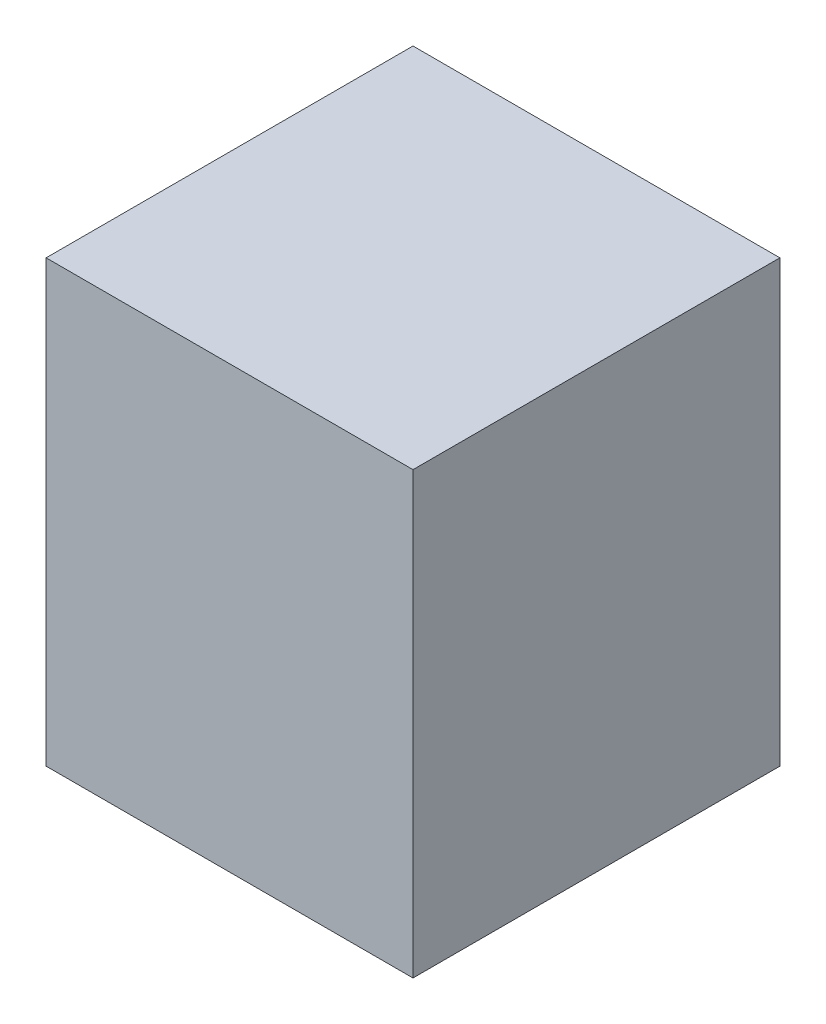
ISO-10303-21;
HEADER;
FILE_DESCRIPTION(('STEP AP214'),'2;1');
FILE_NAME('part.step','',(''),(''),'','','');
FILE_SCHEMA(('AUTOMOTIVE_DESIGN { 1 0 10303 214 1 1 1 1 }'));
ENDSEC;
DATA;
#1=APPLICATION_CONTEXT('core data for automotive mechanical design processes');
#2=APPLICATION_PROTOCOL_DEFINITION('international standard','automotive_design',2000,#1);
#3=PRODUCT_CONTEXT('',#1,'mechanical');
#4=PRODUCT('Part','Part','',(#3));
#5=PRODUCT_RELATED_PRODUCT_CATEGORY('part','',(#4));
#6=PRODUCT_DEFINITION_FORMATION('','',#4);
#7=PRODUCT_DEFINITION_CONTEXT('part definition',#1,'design');
#8=PRODUCT_DEFINITION('design','',#6,#7);
#9=PRODUCT_DEFINITION_SHAPE('','',#8);
#10=(LENGTH_UNIT() NAMED_UNIT(*) SI_UNIT(.MILLI.,.METRE.));
#11=(NAMED_UNIT(*) PLANE_ANGLE_UNIT() SI_UNIT($,.RADIAN.));
#12=(NAMED_UNIT(*) SI_UNIT($,.STERADIAN.) SOLID_ANGLE_UNIT());
#13=UNCERTAINTY_MEASURE_WITH_UNIT(LENGTH_MEASURE(1.E-05),#10,'distance_accuracy_value','');
#14=(GEOMETRIC_REPRESENTATION_CONTEXT(3) GLOBAL_UNCERTAINTY_ASSIGNED_CONTEXT((#13)) GLOBAL_UNIT_ASSIGNED_CONTEXT((#10,
#11,#12)) REPRESENTATION_CONTEXT('',''));
#15=CARTESIAN_POINT('',(0.,0.,0.));
#16=DIRECTION('',(0.,0.,1.));
#17=DIRECTION('',(1.,0.,0.));
#18=AXIS2_PLACEMENT_3D('',#15,#16,#17);
#19=CARTESIAN_POINT('',(0.,0.,0.499999));
#20=DIRECTION('',(0.,0.,1.));
#21=DIRECTION('',(1.,0.,0.));
#22=AXIS2_PLACEMENT_3D('',#19,#20,#21);
#23=PLANE('',#22);
#24=DIRECTION('',(1.,0.,0.));
#25=VECTOR('',#24,1.);
#26=CARTESIAN_POINT('',(-0.2499995,-0.2999994,0.499999));
#27=LINE('',#26,#25);
#28=CARTESIAN_POINT('',(-0.2499995,-0.2999994,0.499999));
#29=VERTEX_POINT('',#28);
#30=CARTESIAN_POINT('',(0.2499995,-0.2999994,0.499999));
#31=VERTEX_POINT('',#30);
#32=EDGE_CURVE('E82',#29,#31,#27,.T.);
#33=ORIENTED_EDGE('',*,*,#32,.T.);
#34=DIRECTION('',(0.,1.,0.));
#35=VECTOR('',#34,1.);
#36=CARTESIAN_POINT('',(0.2499995,-0.2999994,0.499999));
#37=LINE('',#36,#35);
#38=CARTESIAN_POINT('',(0.2499995,0.2999994,0.499999));
#39=VERTEX_POINT('',#38);
#40=EDGE_CURVE('E106',#31,#39,#37,.T.);
#41=ORIENTED_EDGE('',*,*,#40,.T.);
#42=DIRECTION('',(-1.,0.,0.));
#43=VECTOR('',#42,1.);
#44=CARTESIAN_POINT('',(0.2499995,0.2999994,0.499999));
#45=LINE('',#44,#43);
#46=CARTESIAN_POINT('',(-0.2499995,0.2999994,0.499999));
#47=VERTEX_POINT('',#46);
#48=EDGE_CURVE('E75',#39,#47,#45,.T.);
#49=ORIENTED_EDGE('',*,*,#48,.T.);
#50=DIRECTION('',(0.,-1.,0.));
#51=VECTOR('',#50,1.);
#52=CARTESIAN_POINT('',(-0.2499995,0.2999994,0.499999));
#53=LINE('',#52,#51);
#54=EDGE_CURVE('E11',#47,#29,#53,.T.);
#55=ORIENTED_EDGE('',*,*,#54,.T.);
#56=EDGE_LOOP('',(#33,#41,#49,#55));
#57=FACE_BOUND('',#56,.T.);
#58=ADVANCED_FACE('F17',(#57),#23,.T.);
#59=CARTESIAN_POINT('',(0.,0.,0.));
#60=DIRECTION('',(0.,0.,1.));
#61=DIRECTION('',(1.,0.,0.));
#62=AXIS2_PLACEMENT_3D('',#59,#60,#61);
#63=PLANE('',#62);
#64=DIRECTION('',(0.,-1.,0.));
#65=VECTOR('',#64,1.);
#66=CARTESIAN_POINT('',(-0.2499995,0.2999994,0.));
#67=LINE('',#66,#65);
#68=CARTESIAN_POINT('',(-0.2499995,0.2999994,0.));
#69=VERTEX_POINT('',#68);
#70=CARTESIAN_POINT('',(-0.2499995,-0.2999994,0.));
#71=VERTEX_POINT('',#70);
#72=EDGE_CURVE('E20',#69,#71,#67,.T.);
#73=ORIENTED_EDGE('',*,*,#72,.F.);
#74=DIRECTION('',(-1.,0.,0.));
#75=VECTOR('',#74,1.);
#76=CARTESIAN_POINT('',(0.2499995,0.2999994,0.));
#77=LINE('',#76,#75);
#78=CARTESIAN_POINT('',(0.2499995,0.2999994,0.));
#79=VERTEX_POINT('',#78);
#80=EDGE_CURVE('E110',#79,#69,#77,.T.);
#81=ORIENTED_EDGE('',*,*,#80,.F.);
#82=DIRECTION('',(0.,1.,0.));
#83=VECTOR('',#82,1.);
#84=CARTESIAN_POINT('',(0.2499995,-0.2999994,0.));
#85=LINE('',#84,#83);
#86=CARTESIAN_POINT('',(0.2499995,-0.2999994,0.));
#87=VERTEX_POINT('',#86);
#88=EDGE_CURVE('E84',#87,#79,#85,.T.);
#89=ORIENTED_EDGE('',*,*,#88,.F.);
#90=DIRECTION('',(1.,0.,0.));
#91=VECTOR('',#90,1.);
#92=CARTESIAN_POINT('',(-0.2499995,-0.2999994,0.));
#93=LINE('',#92,#91);
#94=EDGE_CURVE('E80',#71,#87,#93,.T.);
#95=ORIENTED_EDGE('',*,*,#94,.F.);
#96=EDGE_LOOP('',(#73,#81,#89,#95));
#97=FACE_BOUND('',#96,.T.);
#98=ADVANCED_FACE('F86',(#97),#63,.F.);
#99=CARTESIAN_POINT('',(-0.2499995,0.2999994,0.));
#100=DIRECTION('',(1.,0.,0.));
#101=DIRECTION('',(0.,1.,0.));
#102=AXIS2_PLACEMENT_3D('',#99,#100,#101);
#103=PLANE('',#102);
#104=ORIENTED_EDGE('',*,*,#72,.T.);
#105=DIRECTION('',(0.,0.,1.));
#106=VECTOR('',#105,1.);
#107=CARTESIAN_POINT('',(-0.2499995,-0.2999994,0.));
#108=LINE('',#107,#106);
#109=EDGE_CURVE('E69',#71,#29,#108,.T.);
#110=ORIENTED_EDGE('',*,*,#109,.T.);
#111=ORIENTED_EDGE('',*,*,#54,.F.);
#112=DIRECTION('',(0.,0.,1.));
#113=VECTOR('',#112,1.);
#114=CARTESIAN_POINT('',(-0.2499995,0.2999994,0.));
#115=LINE('',#114,#113);
#116=EDGE_CURVE('E72',#69,#47,#115,.T.);
#117=ORIENTED_EDGE('',*,*,#116,.F.);
#118=EDGE_LOOP('',(#104,#110,#111,#117));
#119=FACE_BOUND('',#118,.T.);
#120=ADVANCED_FACE('F68',(#119),#103,.F.);
#121=CARTESIAN_POINT('',(0.2499995,0.2999994,0.));
#122=DIRECTION('',(0.,-1.,0.));
#123=DIRECTION('',(0.,0.,-1.));
#124=AXIS2_PLACEMENT_3D('',#121,#122,#123);
#125=PLANE('',#124);
#126=ORIENTED_EDGE('',*,*,#80,.T.);
#127=ORIENTED_EDGE('',*,*,#116,.T.);
#128=ORIENTED_EDGE('',*,*,#48,.F.);
#129=DIRECTION('',(0.,0.,1.));
#130=VECTOR('',#129,1.);
#131=CARTESIAN_POINT('',(0.2499995,0.2999994,0.));
#132=LINE('',#131,#130);
#133=EDGE_CURVE('E102',#79,#39,#132,.T.);
#134=ORIENTED_EDGE('',*,*,#133,.F.);
#135=EDGE_LOOP('',(#126,#127,#128,#134));
#136=FACE_BOUND('',#135,.T.);
#137=ADVANCED_FACE('F120',(#136),#125,.F.);
#138=CARTESIAN_POINT('',(0.2499995,-0.2999994,0.));
#139=DIRECTION('',(-1.,0.,0.));
#140=DIRECTION('',(0.,0.,1.));
#141=AXIS2_PLACEMENT_3D('',#138,#139,#140);
#142=PLANE('',#141);
#143=ORIENTED_EDGE('',*,*,#88,.T.);
#144=ORIENTED_EDGE('',*,*,#133,.T.);
#145=ORIENTED_EDGE('',*,*,#40,.F.);
#146=DIRECTION('',(0.,0.,1.));
#147=VECTOR('',#146,1.);
#148=CARTESIAN_POINT('',(0.2499995,-0.2999994,0.));
#149=LINE('',#148,#147);
#150=EDGE_CURVE('E90',#87,#31,#149,.T.);
#151=ORIENTED_EDGE('',*,*,#150,.F.);
#152=EDGE_LOOP('',(#143,#144,#145,#151));
#153=FACE_BOUND('',#152,.T.);
#154=ADVANCED_FACE('F122',(#153),#142,.F.);
#155=CARTESIAN_POINT('',(-0.2499995,-0.2999994,0.));
#156=DIRECTION('',(0.,1.,0.));
#157=DIRECTION('',(1.,0.,0.));
#158=AXIS2_PLACEMENT_3D('',#155,#156,#157);
#159=PLANE('',#158);
#160=ORIENTED_EDGE('',*,*,#94,.T.);
#161=ORIENTED_EDGE('',*,*,#150,.T.);
#162=ORIENTED_EDGE('',*,*,#32,.F.);
#163=ORIENTED_EDGE('',*,*,#109,.F.);
#164=EDGE_LOOP('',(#160,#161,#162,#163));
#165=FACE_BOUND('',#164,.T.);
#166=ADVANCED_FACE('F78',(#165),#159,.F.);
#167=CLOSED_SHELL('',(#58,#98,#120,#137,#154,#166));
#168=MANIFOLD_SOLID_BREP('B1',#167);
#169=ADVANCED_BREP_SHAPE_REPRESENTATION('',(#18,#168),#14);
#170=SHAPE_DEFINITION_REPRESENTATION(#9,#169);
ENDSEC;
END-ISO-10303-21;
